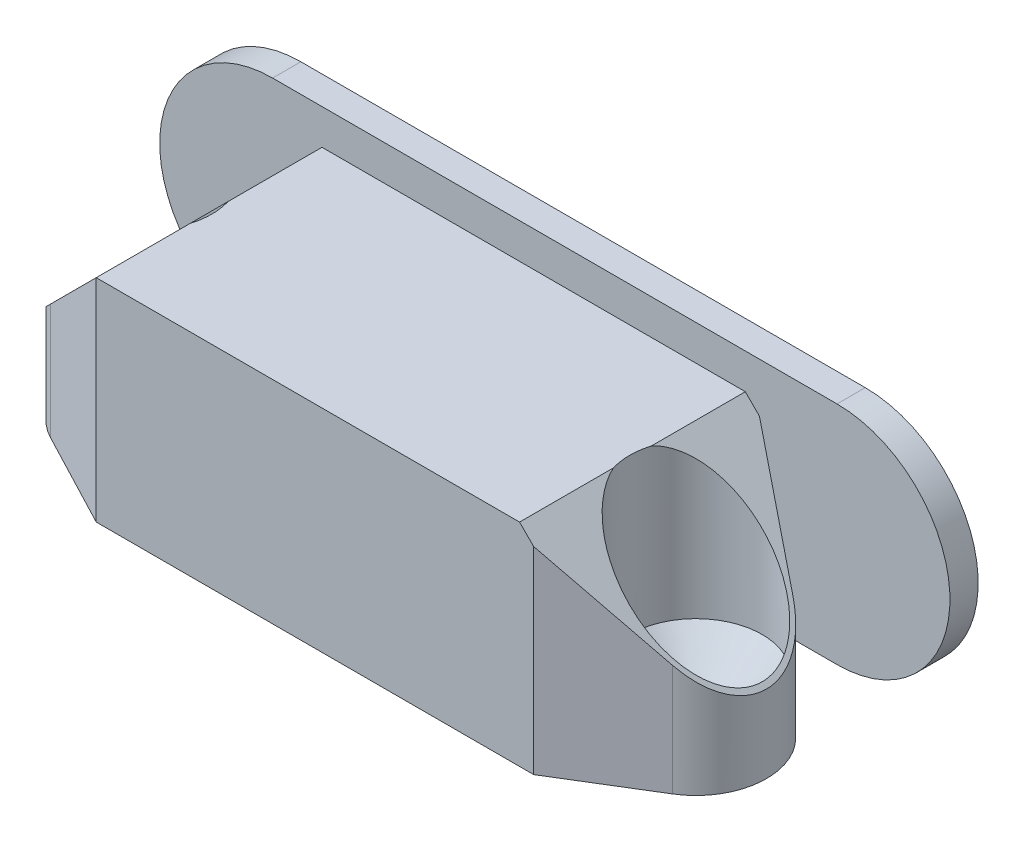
from build123d import *

# Parameters (mm, degrees)
EXTRUSION1_DEPTH        = 2
EXTRUSION2_DEPTH        = 15
ENL_V_MAT_EXTRU_1_DEPTH = 17.5


with BuildPart() as part:
    # Esquisse1 → Extrusion1 (new body)
    with BuildSketch(Plane.XY):
        with BuildLine():
            Line((-20, -8), (20, -8))
            ThreePointArc((20, -8), (28, 0), (20, 8))
            Line((20, 8), (-20, 8))
            ThreePointArc((-20, 8), (-28, 0), (-20, -8))
        make_face()
    extrude(amount=EXTRUSION1_DEPTH)


with BuildPart() as body_2:
    # Esquisse5 → Extrusion2 (new body)
    with BuildSketch(Plane.XZ.offset(8)):
        with BuildLine():
            Line((-15, 3.5), (16, 3.5))
            Line((16, 3.5), (22.107953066, 7.234020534))
            ThreePointArc((22.107953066, 7.234020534), (24.5, 11.5), (22.107953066, 15.765979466))
            Line((22.107953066, 15.765979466), (16, 19.5))
            Line((16, 19.5), (-15, 19.5))
            Line((-15, 19.5), (-21.819241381, 15.929573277))
            ThreePointArc((-21.819241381, 15.929573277), (-24.5, 11.5), (-21.819241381, 7.070426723))
            Line((-21.819241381, 7.070426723), (-15, 3.5))
        make_face()
    extrude(amount=-EXTRUSION2_DEPTH)

    # Esquisse6 → Enl_v. mat.-Extru.1 (cut)
    with BuildSketch(Plane.XY.offset(19.5)):
        Polygon((-15, 7), (-30, -8), (-30, 7), align=None)
    enl_v_mat_extru_1 = extrude(amount=-ENL_V_MAT_EXTRU_1_DEPTH, mode=Mode.SUBTRACT)

    # Esquisse10 → Fraisage pour vis _ t_te frais_e M43 (revolve, cut)
    with BuildSketch(Plane(origin=(-19.5, 7, 11.5), x_dir=(0, 0, 1), z_dir=(1, 0, 0))):
        Polygon((0, 0), (0, 26.291850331), (2.15, 25), (2.15, 13.55), (4.7, 11), (4.7, 0), align=None)
    fraisage_pour_vis_t_te_frais_e_m43 = revolve(axis=Axis((-19.5, 13.35, 11.5), (0, -1, 0)), mode=Mode.SUBTRACT)

    # Sym_trie1: Enl_v. mat.-Extru.1, Fraisage pour vis _ t_te frais_e M43 across plane
    add(enl_v_mat_extru_1.mirror(Plane(origin=(0, 0, 0), x_dir=(0, 0, 1), z_dir=(1, 0, 0))), mode=Mode.SUBTRACT)
    add(fraisage_pour_vis_t_te_frais_e_m43.mirror(Plane(origin=(0, 0, 0), x_dir=(0, 0, 1), z_dir=(1, 0, 0))), mode=Mode.SUBTRACT)


solid = Compound([part.part, body_2.part])
